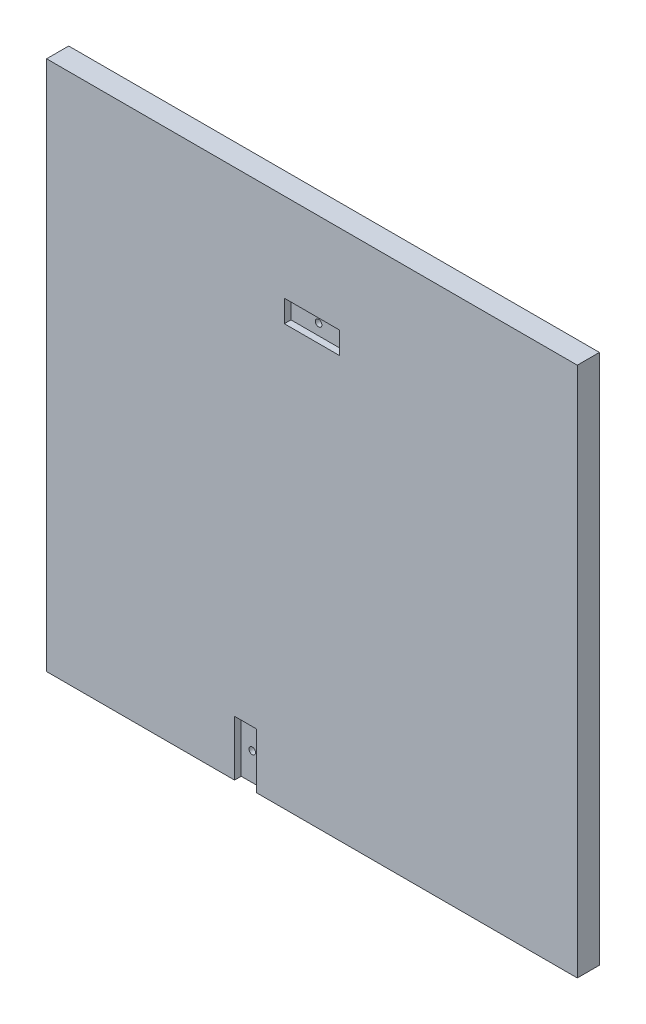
from build123d import *

# Parameters (mm, degrees)
ESQUISSE1_W             = 240
ESQUISSE1_H             = 240
BOSS_EXTRU_1_DEPTH      = 10
ESQUISSE2_R             = 1.5
ENL_V_MAT_EXTRU_1_DEPTH = 10
ESQUISSE3_W             = 10
ESQUISSE3_H             = 25
ESQUISSE3_W_2           = 25
ESQUISSE3_H_2           = 10
ENL_V_MAT_EXTRU_2_DEPTH = 3


with BuildPart() as part:
    # Esquisse1 → Boss.-Extru.1 (new body)
    with BuildSketch(Plane.XY):
        with Locations((120, 120)):
            Rectangle(ESQUISSE1_W, ESQUISSE1_H)
    extrude(amount=BOSS_EXTRU_1_DEPTH)

    # Esquisse2 → Enl_v. mat.-Extru.1 (cut)
    with BuildSketch(Plane.XY.offset(10)):
        with Locations((90, 12.5)):
            Circle(ESQUISSE2_R)
        with Locations((120, 195)):
            Circle(ESQUISSE2_R)
    extrude(amount=-ENL_V_MAT_EXTRU_1_DEPTH, mode=Mode.SUBTRACT)

    # Esquisse3 → Enl_v. mat.-Extru.2 (cut)
    with BuildSketch(Plane.XY.offset(10)):
        with Locations((90, 12.5)):
            Rectangle(ESQUISSE3_W, ESQUISSE3_H)
        with Locations((120, 195)):
            Rectangle(ESQUISSE3_W_2, ESQUISSE3_H_2)
    extrude(amount=-ENL_V_MAT_EXTRU_2_DEPTH, mode=Mode.SUBTRACT)


solid = part.part
